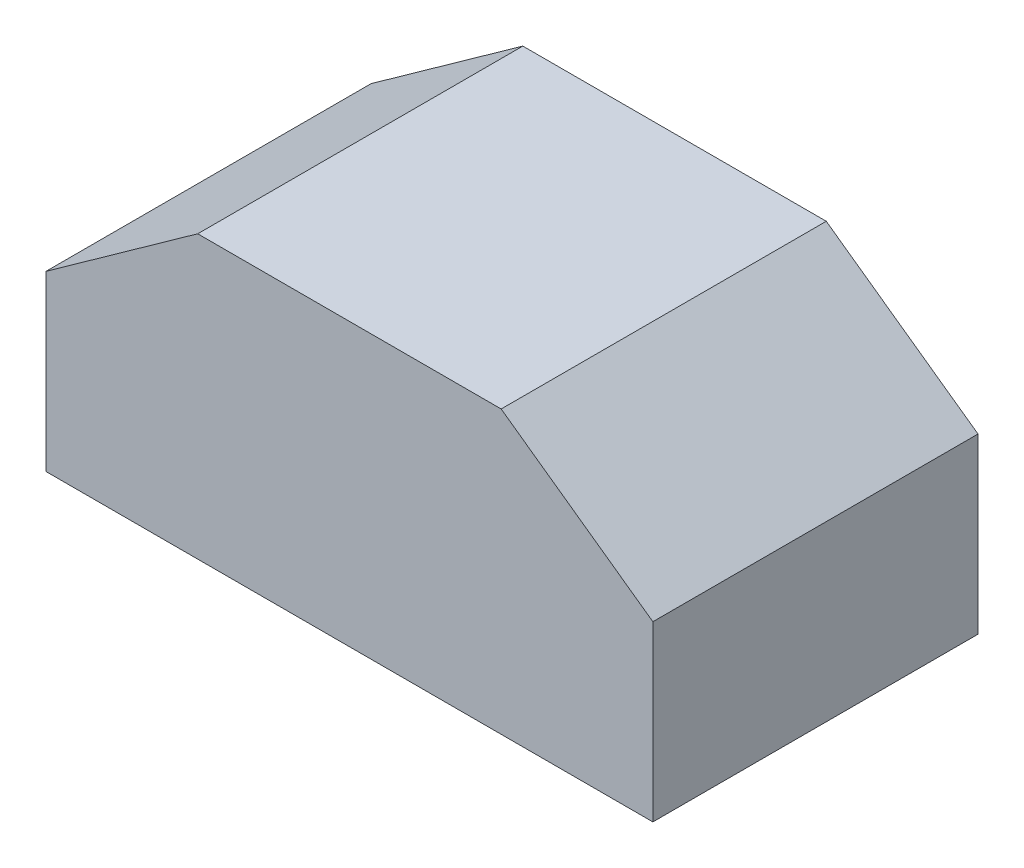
ISO-10303-21;
HEADER;
FILE_DESCRIPTION(('STEP AP214'),'2;1');
FILE_NAME('part.step','',(''),(''),'','','');
FILE_SCHEMA(('AUTOMOTIVE_DESIGN { 1 0 10303 214 1 1 1 1 }'));
ENDSEC;
DATA;
#1=APPLICATION_CONTEXT('core data for automotive mechanical design processes');
#2=APPLICATION_PROTOCOL_DEFINITION('international standard','automotive_design',2000,#1);
#3=PRODUCT_CONTEXT('',#1,'mechanical');
#4=PRODUCT('Part','Part','',(#3));
#5=PRODUCT_RELATED_PRODUCT_CATEGORY('part','',(#4));
#6=PRODUCT_DEFINITION_FORMATION('','',#4);
#7=PRODUCT_DEFINITION_CONTEXT('part definition',#1,'design');
#8=PRODUCT_DEFINITION('design','',#6,#7);
#9=PRODUCT_DEFINITION_SHAPE('','',#8);
#10=(LENGTH_UNIT() NAMED_UNIT(*) SI_UNIT(.MILLI.,.METRE.));
#11=(NAMED_UNIT(*) PLANE_ANGLE_UNIT() SI_UNIT($,.RADIAN.));
#12=(NAMED_UNIT(*) SI_UNIT($,.STERADIAN.) SOLID_ANGLE_UNIT());
#13=UNCERTAINTY_MEASURE_WITH_UNIT(LENGTH_MEASURE(1.E-05),#10,'distance_accuracy_value','');
#14=(GEOMETRIC_REPRESENTATION_CONTEXT(3) GLOBAL_UNCERTAINTY_ASSIGNED_CONTEXT((#13)) GLOBAL_UNIT_ASSIGNED_CONTEXT((#10,
#11,#12)) REPRESENTATION_CONTEXT('',''));
#15=CARTESIAN_POINT('',(0.,0.,0.));
#16=DIRECTION('',(0.,0.,1.));
#17=DIRECTION('',(1.,0.,0.));
#18=AXIS2_PLACEMENT_3D('',#15,#16,#17);
#19=CARTESIAN_POINT('',(-70.,40.,37.5));
#20=DIRECTION('',(1.,0.,0.));
#21=DIRECTION('',(0.,1.,0.));
#22=AXIS2_PLACEMENT_3D('',#19,#20,#21);
#23=PLANE('',#22);
#24=DIRECTION('',(0.,-1.,0.));
#25=VECTOR('',#24,1.);
#26=CARTESIAN_POINT('',(-70.,40.,-37.5));
#27=LINE('',#26,#25);
#28=CARTESIAN_POINT('',(-70.,40.,-37.5));
#29=VERTEX_POINT('',#28);
#30=CARTESIAN_POINT('',(-70.,0.,-37.5));
#31=VERTEX_POINT('',#30);
#32=EDGE_CURVE('E117',#29,#31,#27,.T.);
#33=ORIENTED_EDGE('',*,*,#32,.T.);
#34=DIRECTION('',(0.,0.,-1.));
#35=VECTOR('',#34,1.);
#36=CARTESIAN_POINT('',(-70.,0.,37.5));
#37=LINE('',#36,#35);
#38=CARTESIAN_POINT('',(-70.,0.,37.5));
#39=VERTEX_POINT('',#38);
#40=EDGE_CURVE('E11',#39,#31,#37,.T.);
#41=ORIENTED_EDGE('',*,*,#40,.F.);
#42=DIRECTION('',(0.,-1.,0.));
#43=VECTOR('',#42,1.);
#44=CARTESIAN_POINT('',(-70.,40.,37.5));
#45=LINE('',#44,#43);
#46=CARTESIAN_POINT('',(-70.,40.,37.5));
#47=VERTEX_POINT('',#46);
#48=EDGE_CURVE('E127',#47,#39,#45,.T.);
#49=ORIENTED_EDGE('',*,*,#48,.F.);
#50=DIRECTION('',(0.,0.,-1.));
#51=VECTOR('',#50,1.);
#52=CARTESIAN_POINT('',(-70.,40.,37.5));
#53=LINE('',#52,#51);
#54=EDGE_CURVE('E113',#47,#29,#53,.T.);
#55=ORIENTED_EDGE('',*,*,#54,.T.);
#56=EDGE_LOOP('',(#33,#41,#49,#55));
#57=FACE_BOUND('',#56,.T.);
#58=ADVANCED_FACE('F33',(#57),#23,.F.);
#59=CARTESIAN_POINT('',(-70.,0.,37.5));
#60=DIRECTION('',(0.,1.,0.));
#61=DIRECTION('',(0.,0.,1.));
#62=AXIS2_PLACEMENT_3D('',#59,#60,#61);
#63=PLANE('',#62);
#64=DIRECTION('',(1.,0.,0.));
#65=VECTOR('',#64,1.);
#66=CARTESIAN_POINT('',(-70.,0.,-37.5));
#67=LINE('',#66,#65);
#68=CARTESIAN_POINT('',(70.,0.,-37.5));
#69=VERTEX_POINT('',#68);
#70=EDGE_CURVE('E120',#31,#69,#67,.T.);
#71=ORIENTED_EDGE('',*,*,#70,.T.);
#72=DIRECTION('',(0.,0.,-1.));
#73=VECTOR('',#72,1.);
#74=CARTESIAN_POINT('',(70.,0.,37.5));
#75=LINE('',#74,#73);
#76=CARTESIAN_POINT('',(70.,0.,37.5));
#77=VERTEX_POINT('',#76);
#78=EDGE_CURVE('E41',#77,#69,#75,.T.);
#79=ORIENTED_EDGE('',*,*,#78,.F.);
#80=DIRECTION('',(1.,0.,0.));
#81=VECTOR('',#80,1.);
#82=CARTESIAN_POINT('',(-70.,0.,37.5));
#83=LINE('',#82,#81);
#84=EDGE_CURVE('E86',#39,#77,#83,.T.);
#85=ORIENTED_EDGE('',*,*,#84,.F.);
#86=ORIENTED_EDGE('',*,*,#40,.T.);
#87=EDGE_LOOP('',(#71,#79,#85,#86));
#88=FACE_BOUND('',#87,.T.);
#89=ADVANCED_FACE('F151',(#88),#63,.F.);
#90=CARTESIAN_POINT('',(70.,0.,37.5));
#91=DIRECTION('',(-1.,0.,0.));
#92=DIRECTION('',(0.,-1.,0.));
#93=AXIS2_PLACEMENT_3D('',#90,#91,#92);
#94=PLANE('',#93);
#95=DIRECTION('',(0.,1.,0.));
#96=VECTOR('',#95,1.);
#97=CARTESIAN_POINT('',(70.,0.,-37.5));
#98=LINE('',#97,#96);
#99=CARTESIAN_POINT('',(70.,40.,-37.5));
#100=VERTEX_POINT('',#99);
#101=EDGE_CURVE('E122',#69,#100,#98,.T.);
#102=ORIENTED_EDGE('',*,*,#101,.T.);
#103=DIRECTION('',(0.,0.,-1.));
#104=VECTOR('',#103,1.);
#105=CARTESIAN_POINT('',(70.,40.,37.5));
#106=LINE('',#105,#104);
#107=CARTESIAN_POINT('',(70.,40.,37.5));
#108=VERTEX_POINT('',#107);
#109=EDGE_CURVE('E108',#108,#100,#106,.T.);
#110=ORIENTED_EDGE('',*,*,#109,.F.);
#111=DIRECTION('',(0.,1.,0.));
#112=VECTOR('',#111,1.);
#113=CARTESIAN_POINT('',(70.,0.,37.5));
#114=LINE('',#113,#112);
#115=EDGE_CURVE('E99',#77,#108,#114,.T.);
#116=ORIENTED_EDGE('',*,*,#115,.F.);
#117=ORIENTED_EDGE('',*,*,#78,.T.);
#118=EDGE_LOOP('',(#102,#110,#116,#117));
#119=FACE_BOUND('',#118,.T.);
#120=ADVANCED_FACE('F133',(#119),#94,.F.);
#121=CARTESIAN_POINT('',(70.,40.,37.5));
#122=DIRECTION('',(-0.581238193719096,-0.813733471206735,0.));
#123=DIRECTION('',(0.813733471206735,-0.581238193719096,0.));
#124=AXIS2_PLACEMENT_3D('',#121,#122,#123);
#125=PLANE('',#124);
#126=DIRECTION('',(-0.813733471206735,0.581238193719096,0.));
#127=VECTOR('',#126,1.);
#128=CARTESIAN_POINT('',(70.,40.,-37.5));
#129=LINE('',#128,#127);
#130=CARTESIAN_POINT('',(35.,65.,-37.5));
#131=VERTEX_POINT('',#130);
#132=EDGE_CURVE('E107',#100,#131,#129,.T.);
#133=ORIENTED_EDGE('',*,*,#132,.T.);
#134=DIRECTION('',(0.,0.,-1.));
#135=VECTOR('',#134,1.);
#136=CARTESIAN_POINT('',(35.,65.,37.5));
#137=LINE('',#136,#135);
#138=CARTESIAN_POINT('',(35.,65.,37.5));
#139=VERTEX_POINT('',#138);
#140=EDGE_CURVE('E104',#139,#131,#137,.T.);
#141=ORIENTED_EDGE('',*,*,#140,.F.);
#142=DIRECTION('',(-0.813733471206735,0.581238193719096,0.));
#143=VECTOR('',#142,1.);
#144=CARTESIAN_POINT('',(70.,40.,37.5));
#145=LINE('',#144,#143);
#146=EDGE_CURVE('E93',#108,#139,#145,.T.);
#147=ORIENTED_EDGE('',*,*,#146,.F.);
#148=ORIENTED_EDGE('',*,*,#109,.T.);
#149=EDGE_LOOP('',(#133,#141,#147,#148));
#150=FACE_BOUND('',#149,.T.);
#151=ADVANCED_FACE('F105',(#150),#125,.F.);
#152=CARTESIAN_POINT('',(35.,65.,37.5));
#153=DIRECTION('',(0.,-1.,0.));
#154=DIRECTION('',(0.,0.,-1.));
#155=AXIS2_PLACEMENT_3D('',#152,#153,#154);
#156=PLANE('',#155);
#157=DIRECTION('',(-1.,0.,0.));
#158=VECTOR('',#157,1.);
#159=CARTESIAN_POINT('',(35.,65.,-37.5));
#160=LINE('',#159,#158);
#161=CARTESIAN_POINT('',(-35.,65.,-37.5));
#162=VERTEX_POINT('',#161);
#163=EDGE_CURVE('E72',#131,#162,#160,.T.);
#164=ORIENTED_EDGE('',*,*,#163,.T.);
#165=DIRECTION('',(0.,0.,-1.));
#166=VECTOR('',#165,1.);
#167=CARTESIAN_POINT('',(-35.,65.,37.5));
#168=LINE('',#167,#166);
#169=CARTESIAN_POINT('',(-35.,65.,37.5));
#170=VERTEX_POINT('',#169);
#171=EDGE_CURVE('E109',#170,#162,#168,.T.);
#172=ORIENTED_EDGE('',*,*,#171,.F.);
#173=DIRECTION('',(-1.,0.,0.));
#174=VECTOR('',#173,1.);
#175=CARTESIAN_POINT('',(35.,65.,37.5));
#176=LINE('',#175,#174);
#177=EDGE_CURVE('E97',#139,#170,#176,.T.);
#178=ORIENTED_EDGE('',*,*,#177,.F.);
#179=ORIENTED_EDGE('',*,*,#140,.T.);
#180=EDGE_LOOP('',(#164,#172,#178,#179));
#181=FACE_BOUND('',#180,.T.);
#182=ADVANCED_FACE('F111',(#181),#156,.F.);
#183=CARTESIAN_POINT('',(-35.,65.,37.5));
#184=DIRECTION('',(0.581238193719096,-0.813733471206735,0.));
#185=DIRECTION('',(0.813733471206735,0.581238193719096,0.));
#186=AXIS2_PLACEMENT_3D('',#183,#184,#185);
#187=PLANE('',#186);
#188=DIRECTION('',(-0.813733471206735,-0.581238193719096,0.));
#189=VECTOR('',#188,1.);
#190=CARTESIAN_POINT('',(-35.,65.,-37.5));
#191=LINE('',#190,#189);
#192=EDGE_CURVE('E78',#162,#29,#191,.T.);
#193=ORIENTED_EDGE('',*,*,#192,.T.);
#194=ORIENTED_EDGE('',*,*,#54,.F.);
#195=DIRECTION('',(-0.813733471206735,-0.581238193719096,0.));
#196=VECTOR('',#195,1.);
#197=CARTESIAN_POINT('',(-35.,65.,37.5));
#198=LINE('',#197,#196);
#199=EDGE_CURVE('E49',#170,#47,#198,.T.);
#200=ORIENTED_EDGE('',*,*,#199,.F.);
#201=ORIENTED_EDGE('',*,*,#171,.T.);
#202=EDGE_LOOP('',(#193,#194,#200,#201));
#203=FACE_BOUND('',#202,.T.);
#204=ADVANCED_FACE('F140',(#203),#187,.F.);
#205=CARTESIAN_POINT('',(0.,0.,37.5));
#206=DIRECTION('',(0.,0.,1.));
#207=DIRECTION('',(1.,0.,0.));
#208=AXIS2_PLACEMENT_3D('',#205,#206,#207);
#209=PLANE('',#208);
#210=ORIENTED_EDGE('',*,*,#48,.T.);
#211=ORIENTED_EDGE('',*,*,#84,.T.);
#212=ORIENTED_EDGE('',*,*,#115,.T.);
#213=ORIENTED_EDGE('',*,*,#146,.T.);
#214=ORIENTED_EDGE('',*,*,#177,.T.);
#215=ORIENTED_EDGE('',*,*,#199,.T.);
#216=EDGE_LOOP('',(#210,#211,#212,#213,#214,#215));
#217=FACE_BOUND('',#216,.T.);
#218=ADVANCED_FACE('F95',(#217),#209,.T.);
#219=CARTESIAN_POINT('',(0.,0.,-37.5));
#220=DIRECTION('',(0.,0.,1.));
#221=DIRECTION('',(1.,0.,0.));
#222=AXIS2_PLACEMENT_3D('',#219,#220,#221);
#223=PLANE('',#222);
#224=ORIENTED_EDGE('',*,*,#32,.F.);
#225=ORIENTED_EDGE('',*,*,#192,.F.);
#226=ORIENTED_EDGE('',*,*,#163,.F.);
#227=ORIENTED_EDGE('',*,*,#132,.F.);
#228=ORIENTED_EDGE('',*,*,#101,.F.);
#229=ORIENTED_EDGE('',*,*,#70,.F.);
#230=EDGE_LOOP('',(#224,#225,#226,#227,#228,#229));
#231=FACE_BOUND('',#230,.T.);
#232=ADVANCED_FACE('F136',(#231),#223,.F.);
#233=CLOSED_SHELL('',(#58,#89,#120,#151,#182,#204,#218,#232));
#234=MANIFOLD_SOLID_BREP('B2',#233);
#235=ADVANCED_BREP_SHAPE_REPRESENTATION('',(#18,#234),#14);
#236=SHAPE_DEFINITION_REPRESENTATION(#9,#235);
ENDSEC;
END-ISO-10303-21;
